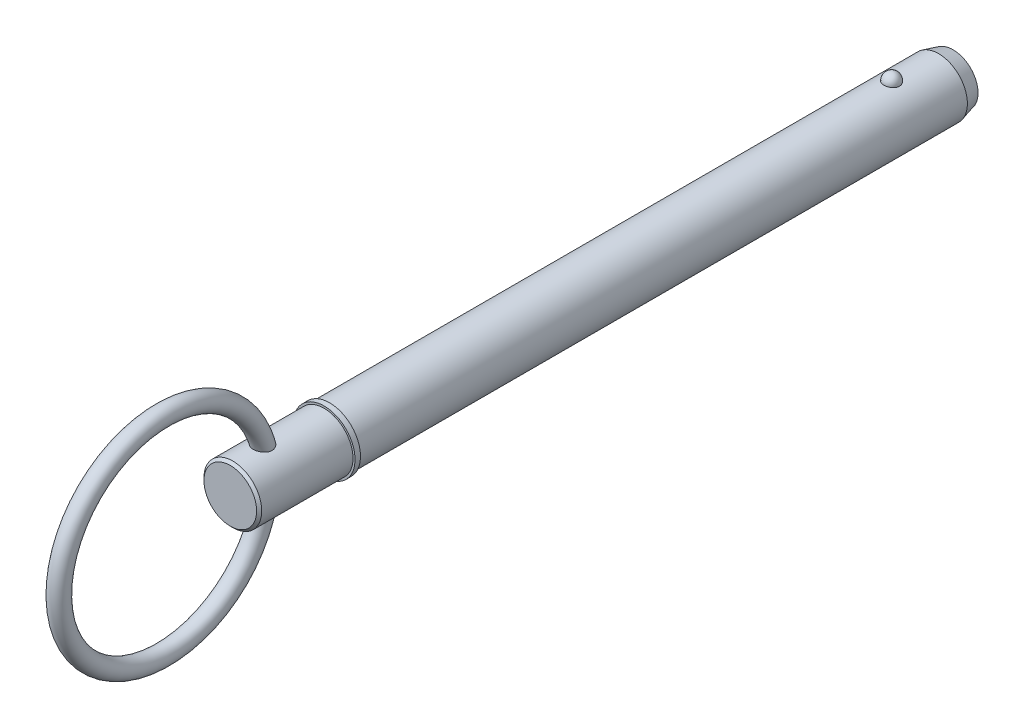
from build123d import *

# Parameters (mm, degrees)
SKETCH2_R           = 7.94
BOSS_EXTRUDE1_DEPTH = 152.4
BOSS_EXTRUDE2_START = 19.05
SKETCH3_R           = 7.94
BOSS_EXTRUDE2_DEPTH = 19.05
CHAMFER1_SIZE       = 4
CHAMFER1_SIZE2      = 1.07179677
SKETCH20_W          = 1.5
SKETCH20_H          = 8.5
SKETCH21_R          = 7.94
BOSS_EXTRUDE3_DEPTH = 27.31
CHAMFER2_SIZE       = 0.7
SKETCH24_R          = 2.5


with BuildPart() as part:
    # Sketch2 → Boss-Extrude1 (new body)
    with BuildSketch(Plane.XY):
        with Locations(Location((0, 0, 0), (0, 0, 180))):
            Circle(SKETCH2_R)
    extrude(amount=BOSS_EXTRUDE1_DEPTH)

    # Sketch3 → Boss-Extrude2 (add)
    with BuildSketch(Plane(origin=(0, 0, 0), x_dir=(-1, 0, 0), z_dir=(0, 0, -1)).offset(BOSS_EXTRUDE2_START)):
        Circle(SKETCH3_R)
    extrude(amount=-BOSS_EXTRUDE2_DEPTH)

    # Chamfer1
    chamfer1_edges = [part.edges().sort_by_distance(p)[0] for p in [
        (7.94, 0, -19.05),
    ]]
    chamfer1_side = [part.faces().sort_by_distance(p)[0] for p in [
        (7.94, 0, 66.675),
    ]]
    chamfer(chamfer1_edges, length=CHAMFER1_SIZE, length2=CHAMFER1_SIZE2, reference=chamfer1_side[0])

    # Sketch18 → Revolve1 (revolve)
    with BuildSketch(Plane(origin=(0, 0, 0), x_dir=(0, 0, -1), z_dir=(1, 0, 0))):
        with BuildLine():
            Line((2.15, 10.09), (2.15, 5.79))
            ThreePointArc((2.15, 5.79), (0, 7.94), (2.15, 10.09))
        make_face()
    revolve(axis=Axis((0, 10.09, -2.15), (0, -1, 0)))

    # Sketch20 → Revolve2 (revolve)
    with BuildSketch(Plane(origin=(0, 0, 0), x_dir=(0, 0, -1), z_dir=(1, 0, 0)), mode=Mode.PRIVATE) as revolve2_sk:
        with Locations((-153.15, 4.25)):
            Rectangle(SKETCH20_W, SKETCH20_H)
    revolve(revolve2_sk.sketch.rotate(Axis((0, 0, 33.728787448), (0, 0, 1)), 90), axis=Axis((0, 0, 33.728787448), (0, 0, 1)))

    # Sketch21 → Boss-Extrude3 (add)
    with BuildSketch(Plane(origin=(0, 0, 152.4), x_dir=(-1, 0, 0), z_dir=(0, 0, -1))):
        Circle(SKETCH21_R)
    extrude(amount=-BOSS_EXTRUDE3_DEPTH)

    # Chamfer2
    chamfer2_edges = [part.edges().sort_by_distance(p)[0] for p in [
        (7.94, 0, 179.71),
    ]]
    chamfer(chamfer2_edges, length=CHAMFER2_SIZE)

    # Sweep1: sweep along a path in Sketch23
    with BuildLine(Plane(origin=(0, 0, 0), x_dir=(0, 0, -1), z_dir=(1, 0, 0))) as sweep1_path:
        CenterArc((-198.285, 0), 28.575, 0, 360)
    # Sketch24 → Sweep1 (sweep)
    with BuildSketch(Plane(origin=(0, 0, 0), x_dir=(1, 0, 0), z_dir=(0, 1, 0))):
        with Locations((0, -169.71)):
            Circle(SKETCH24_R)
    sweep(path=sweep1_path.line)


solid = part.part
